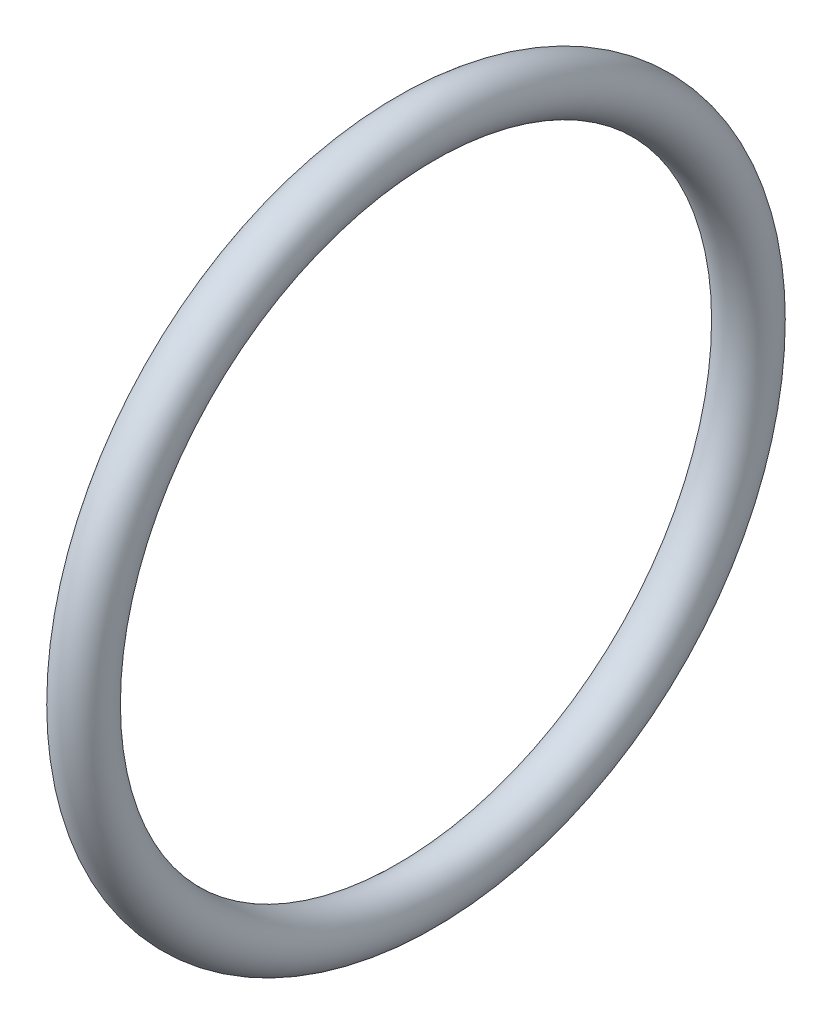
from build123d import *

# Parameters (mm, degrees)
ESQUISSE1_R = 2


with BuildPart() as part:
    # Esquisse1 → R_volution1 (revolve)
    with BuildSketch(Plane.XY, mode=Mode.PRIVATE) as r_volution1_sk:
        with Locations((0, 25.5)):
            Circle(ESQUISSE1_R)
    revolve(r_volution1_sk.sketch.rotate(Axis((-11.093754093, 0, 0), (1, 0, 0)), 90), axis=Axis((-11.093754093, 0, 0), (1, 0, 0)))


solid = part.part
